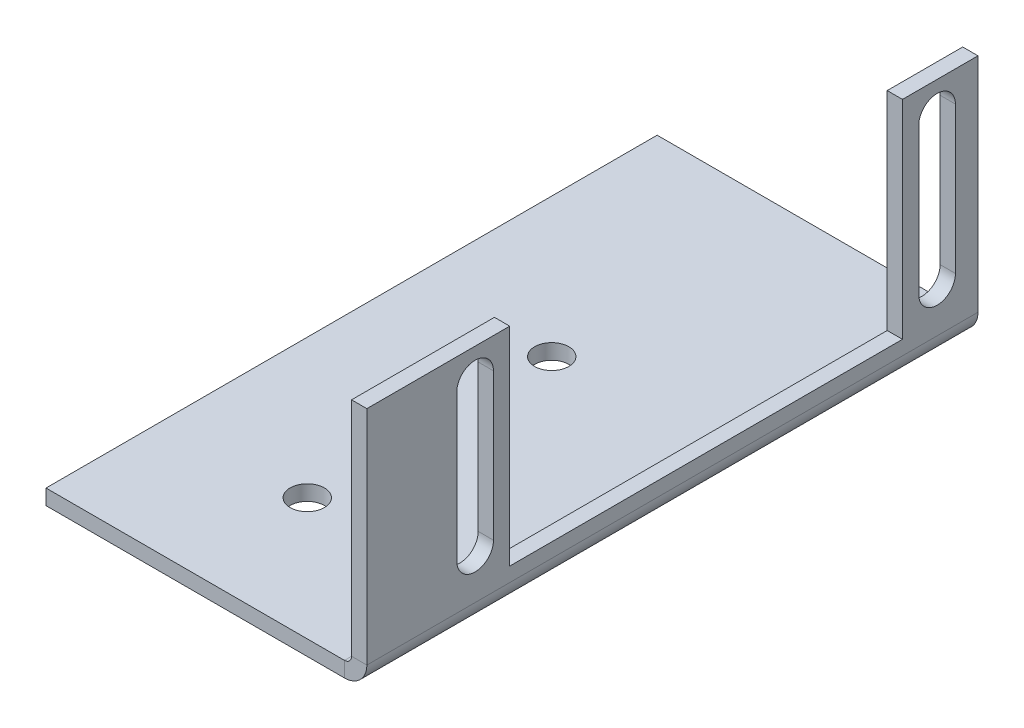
ISO-10303-21;
HEADER;
FILE_DESCRIPTION(('STEP AP214'),'2;1');
FILE_NAME('part.step','',(''),(''),'','','');
FILE_SCHEMA(('AUTOMOTIVE_DESIGN { 1 0 10303 214 1 1 1 1 }'));
ENDSEC;
DATA;
#1=APPLICATION_CONTEXT('core data for automotive mechanical design processes');
#2=APPLICATION_PROTOCOL_DEFINITION('international standard','automotive_design',2000,#1);
#3=PRODUCT_CONTEXT('',#1,'mechanical');
#4=PRODUCT('Part','Part','',(#3));
#5=PRODUCT_RELATED_PRODUCT_CATEGORY('part','',(#4));
#6=PRODUCT_DEFINITION_FORMATION('','',#4);
#7=PRODUCT_DEFINITION_CONTEXT('part definition',#1,'design');
#8=PRODUCT_DEFINITION('design','',#6,#7);
#9=PRODUCT_DEFINITION_SHAPE('','',#8);
#10=(LENGTH_UNIT() NAMED_UNIT(*) SI_UNIT(.MILLI.,.METRE.));
#11=(NAMED_UNIT(*) PLANE_ANGLE_UNIT() SI_UNIT($,.RADIAN.));
#12=(NAMED_UNIT(*) SI_UNIT($,.STERADIAN.) SOLID_ANGLE_UNIT());
#13=UNCERTAINTY_MEASURE_WITH_UNIT(LENGTH_MEASURE(1.E-05),#10,'distance_accuracy_value','');
#14=(GEOMETRIC_REPRESENTATION_CONTEXT(3) GLOBAL_UNCERTAINTY_ASSIGNED_CONTEXT((#13)) GLOBAL_UNIT_ASSIGNED_CONTEXT((#10,
#11,#12)) REPRESENTATION_CONTEXT('',''));
#15=CARTESIAN_POINT('',(0.,0.,0.));
#16=DIRECTION('',(0.,0.,1.));
#17=DIRECTION('',(1.,0.,0.));
#18=AXIS2_PLACEMENT_3D('',#15,#16,#17);
#19=CARTESIAN_POINT('',(33.3375000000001,23.8125,0.));
#20=DIRECTION('',(0.,-1.,0.));
#21=DIRECTION('',(1.,0.,0.));
#22=AXIS2_PLACEMENT_3D('',#19,#20,#21);
#23=PLANE('',#22);
#24=DIRECTION('',(0.,0.,1.));
#25=VECTOR('',#24,1.);
#26=CARTESIAN_POINT('',(33.3375000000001,23.8125,0.));
#27=LINE('',#26,#25);
#28=CARTESIAN_POINT('',(33.3375000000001,23.8125,-14.846));
#29=VERTEX_POINT('',#28);
#30=CARTESIAN_POINT('',(33.3375000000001,23.8125,0.));
#31=VERTEX_POINT('',#30);
#32=EDGE_CURVE('E272',#29,#31,#27,.T.);
#33=ORIENTED_EDGE('',*,*,#32,.F.);
#34=DIRECTION('',(-1.,0.,0.));
#35=VECTOR('',#34,1.);
#36=CARTESIAN_POINT('',(33.3375000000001,23.8125,-14.846));
#37=LINE('',#36,#35);
#38=CARTESIAN_POINT('',(31.7500000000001,23.8125,-14.846));
#39=VERTEX_POINT('',#38);
#40=EDGE_CURVE('E336',#29,#39,#37,.T.);
#41=ORIENTED_EDGE('',*,*,#40,.T.);
#42=DIRECTION('',(0.,0.,1.));
#43=VECTOR('',#42,1.);
#44=CARTESIAN_POINT('',(31.7500000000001,23.8125,0.));
#45=LINE('',#44,#43);
#46=CARTESIAN_POINT('',(31.7500000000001,23.8125,0.));
#47=VERTEX_POINT('',#46);
#48=EDGE_CURVE('E281',#39,#47,#45,.T.);
#49=ORIENTED_EDGE('',*,*,#48,.T.);
#50=DIRECTION('',(-1.,0.,0.));
#51=VECTOR('',#50,1.);
#52=CARTESIAN_POINT('',(33.3375000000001,23.8125,0.));
#53=LINE('',#52,#51);
#54=EDGE_CURVE('E276',#31,#47,#53,.T.);
#55=ORIENTED_EDGE('',*,*,#54,.F.);
#56=EDGE_LOOP('',(#33,#41,#49,#55));
#57=FACE_BOUND('',#56,.T.);
#58=ADVANCED_FACE('F40',(#57),#23,.F.);
#59=CARTESIAN_POINT('',(0.,-1.5875,-63.5));
#60=DIRECTION('',(0.,0.,-1.));
#61=DIRECTION('',(-1.,0.,0.));
#62=AXIS2_PLACEMENT_3D('',#59,#60,#61);
#63=PLANE('',#62);
#64=DIRECTION('',(-1.,0.,0.));
#65=VECTOR('',#64,1.);
#66=CARTESIAN_POINT('',(0.,0.,-63.5));
#67=LINE('',#66,#65);
#68=CARTESIAN_POINT('',(31.0134,0.,-63.5));
#69=VERTEX_POINT('',#68);
#70=CARTESIAN_POINT('',(0.,0.,-63.5));
#71=VERTEX_POINT('',#70);
#72=EDGE_CURVE('E317',#69,#71,#67,.T.);
#73=ORIENTED_EDGE('',*,*,#72,.F.);
#74=DIRECTION('',(0.,-1.,0.));
#75=VECTOR('',#74,1.);
#76=CARTESIAN_POINT('',(31.0134,0.,-63.5));
#77=LINE('',#76,#75);
#78=CARTESIAN_POINT('',(31.0134,-1.5875,-63.5));
#79=VERTEX_POINT('',#78);
#80=EDGE_CURVE('E297',#69,#79,#77,.T.);
#81=ORIENTED_EDGE('',*,*,#80,.T.);
#82=DIRECTION('',(-1.,0.,0.));
#83=VECTOR('',#82,1.);
#84=CARTESIAN_POINT('',(0.,-1.5875,-63.5));
#85=LINE('',#84,#83);
#86=CARTESIAN_POINT('',(0.,-1.5875,-63.5));
#87=VERTEX_POINT('',#86);
#88=EDGE_CURVE('E320',#79,#87,#85,.T.);
#89=ORIENTED_EDGE('',*,*,#88,.T.);
#90=DIRECTION('',(0.,1.,0.));
#91=VECTOR('',#90,1.);
#92=CARTESIAN_POINT('',(0.,-1.5875,-63.5));
#93=LINE('',#92,#91);
#94=EDGE_CURVE('E329',#87,#71,#93,.T.);
#95=ORIENTED_EDGE('',*,*,#94,.T.);
#96=EDGE_LOOP('',(#73,#81,#89,#95));
#97=FACE_BOUND('',#96,.T.);
#98=ADVANCED_FACE('F386',(#97),#63,.T.);
#99=CARTESIAN_POINT('',(0.,-1.5875,0.));
#100=DIRECTION('',(0.,-1.,0.));
#101=DIRECTION('',(0.,0.,-1.));
#102=AXIS2_PLACEMENT_3D('',#99,#100,#101);
#103=PLANE('',#102);
#104=CARTESIAN_POINT('',(14.44625,-1.5875,-38.1));
#105=DIRECTION('',(0.,1.,0.));
#106=DIRECTION('',(0.,0.,1.));
#107=AXIS2_PLACEMENT_3D('',#104,#105,#106);
#108=CIRCLE('',#107,1.778);
#109=CARTESIAN_POINT('',(14.44625,-1.5875,-36.322));
#110=VERTEX_POINT('',#109);
#111=EDGE_CURVE('E244',#110,#110,#108,.T.);
#112=ORIENTED_EDGE('',*,*,#111,.T.);
#113=EDGE_LOOP('',(#112));
#114=FACE_BOUND('',#113,.T.);
#115=CARTESIAN_POINT('',(14.44625,-1.5875,-12.7));
#116=DIRECTION('',(0.,1.,0.));
#117=DIRECTION('',(0.,0.,1.));
#118=AXIS2_PLACEMENT_3D('',#115,#116,#117);
#119=CIRCLE('',#118,1.778);
#120=CARTESIAN_POINT('',(14.44625,-1.5875,-10.922));
#121=VERTEX_POINT('',#120);
#122=EDGE_CURVE('E251',#121,#121,#119,.T.);
#123=ORIENTED_EDGE('',*,*,#122,.T.);
#124=EDGE_LOOP('',(#123));
#125=FACE_BOUND('',#124,.T.);
#126=ORIENTED_EDGE('',*,*,#88,.F.);
#127=DIRECTION('',(0.,0.,-1.));
#128=VECTOR('',#127,1.);
#129=CARTESIAN_POINT('',(31.0134,-1.5875,-63.5));
#130=LINE('',#129,#128);
#131=CARTESIAN_POINT('',(31.0134,-1.5875,0.));
#132=VERTEX_POINT('',#131);
#133=EDGE_CURVE('E290',#79,#132,#130,.F.);
#134=ORIENTED_EDGE('',*,*,#133,.T.);
#135=DIRECTION('',(1.,0.,0.));
#136=VECTOR('',#135,1.);
#137=CARTESIAN_POINT('',(0.,-1.5875,0.));
#138=LINE('',#137,#136);
#139=CARTESIAN_POINT('',(0.,-1.5875,0.));
#140=VERTEX_POINT('',#139);
#141=EDGE_CURVE('E316',#140,#132,#138,.T.);
#142=ORIENTED_EDGE('',*,*,#141,.F.);
#143=DIRECTION('',(0.,0.,1.));
#144=VECTOR('',#143,1.);
#145=CARTESIAN_POINT('',(0.,-1.5875,0.));
#146=LINE('',#145,#144);
#147=EDGE_CURVE('E313',#87,#140,#146,.T.);
#148=ORIENTED_EDGE('',*,*,#147,.F.);
#149=EDGE_LOOP('',(#126,#134,#142,#148));
#150=FACE_BOUND('',#149,.T.);
#151=ADVANCED_FACE('F393',(#114,#125,#150),#103,.T.);
#152=CARTESIAN_POINT('',(0.,0.,0.));
#153=DIRECTION('',(0.,-1.,0.));
#154=DIRECTION('',(0.,0.,-1.));
#155=AXIS2_PLACEMENT_3D('',#152,#153,#154);
#156=PLANE('',#155);
#157=CARTESIAN_POINT('',(14.44625,0.,-38.1));
#158=DIRECTION('',(0.,1.,0.));
#159=DIRECTION('',(0.,0.,1.));
#160=AXIS2_PLACEMENT_3D('',#157,#158,#159);
#161=CIRCLE('',#160,1.778);
#162=CARTESIAN_POINT('',(14.44625,0.,-36.322));
#163=VERTEX_POINT('',#162);
#164=EDGE_CURVE('E248',#163,#163,#161,.T.);
#165=ORIENTED_EDGE('',*,*,#164,.F.);
#166=EDGE_LOOP('',(#165));
#167=FACE_BOUND('',#166,.T.);
#168=CARTESIAN_POINT('',(14.44625,0.,-12.7));
#169=DIRECTION('',(0.,1.,0.));
#170=DIRECTION('',(0.,0.,1.));
#171=AXIS2_PLACEMENT_3D('',#168,#169,#170);
#172=CIRCLE('',#171,1.778);
#173=CARTESIAN_POINT('',(14.44625,0.,-10.922));
#174=VERTEX_POINT('',#173);
#175=EDGE_CURVE('E243',#174,#174,#172,.T.);
#176=ORIENTED_EDGE('',*,*,#175,.F.);
#177=EDGE_LOOP('',(#176));
#178=FACE_BOUND('',#177,.T.);
#179=DIRECTION('',(0.,0.,-1.));
#180=VECTOR('',#179,1.);
#181=CARTESIAN_POINT('',(31.0134,0.,-63.5));
#182=LINE('',#181,#180);
#183=CARTESIAN_POINT('',(31.0134,0.,0.));
#184=VERTEX_POINT('',#183);
#185=EDGE_CURVE('E303',#69,#184,#182,.F.);
#186=ORIENTED_EDGE('',*,*,#185,.F.);
#187=ORIENTED_EDGE('',*,*,#72,.T.);
#188=DIRECTION('',(0.,0.,1.));
#189=VECTOR('',#188,1.);
#190=CARTESIAN_POINT('',(0.,0.,0.));
#191=LINE('',#190,#189);
#192=CARTESIAN_POINT('',(0.,0.,0.));
#193=VERTEX_POINT('',#192);
#194=EDGE_CURVE('E310',#71,#193,#191,.T.);
#195=ORIENTED_EDGE('',*,*,#194,.T.);
#196=DIRECTION('',(1.,0.,0.));
#197=VECTOR('',#196,1.);
#198=CARTESIAN_POINT('',(0.,0.,0.));
#199=LINE('',#198,#197);
#200=EDGE_CURVE('E325',#193,#184,#199,.T.);
#201=ORIENTED_EDGE('',*,*,#200,.T.);
#202=EDGE_LOOP('',(#186,#187,#195,#201));
#203=FACE_BOUND('',#202,.T.);
#204=ADVANCED_FACE('F436',(#167,#178,#203),#156,.F.);
#205=CARTESIAN_POINT('',(0.,-1.5875,0.));
#206=DIRECTION('',(-1.,0.,0.));
#207=DIRECTION('',(0.,0.,1.));
#208=AXIS2_PLACEMENT_3D('',#205,#206,#207);
#209=PLANE('',#208);
#210=ORIENTED_EDGE('',*,*,#194,.F.);
#211=ORIENTED_EDGE('',*,*,#94,.F.);
#212=ORIENTED_EDGE('',*,*,#147,.T.);
#213=DIRECTION('',(0.,1.,0.));
#214=VECTOR('',#213,1.);
#215=CARTESIAN_POINT('',(0.,-1.5875,0.));
#216=LINE('',#215,#214);
#217=EDGE_CURVE('E322',#140,#193,#216,.T.);
#218=ORIENTED_EDGE('',*,*,#217,.T.);
#219=EDGE_LOOP('',(#210,#211,#212,#218));
#220=FACE_BOUND('',#219,.T.);
#221=ADVANCED_FACE('F42',(#220),#209,.T.);
#222=CARTESIAN_POINT('',(0.,-1.5875,0.));
#223=DIRECTION('',(0.,0.,1.));
#224=DIRECTION('',(1.,0.,0.));
#225=AXIS2_PLACEMENT_3D('',#222,#223,#224);
#226=PLANE('',#225);
#227=DIRECTION('',(0.,-1.,0.));
#228=VECTOR('',#227,1.);
#229=CARTESIAN_POINT('',(31.0134,0.,0.));
#230=LINE('',#229,#228);
#231=EDGE_CURVE('E307',#184,#132,#230,.T.);
#232=ORIENTED_EDGE('',*,*,#231,.F.);
#233=ORIENTED_EDGE('',*,*,#200,.F.);
#234=ORIENTED_EDGE('',*,*,#217,.F.);
#235=ORIENTED_EDGE('',*,*,#141,.T.);
#236=EDGE_LOOP('',(#232,#233,#234,#235));
#237=FACE_BOUND('',#236,.T.);
#238=ADVANCED_FACE('F446',(#237),#226,.T.);
#239=CARTESIAN_POINT('',(31.0134,0.7366,0.));
#240=DIRECTION('',(0.,0.,1.));
#241=DIRECTION('',(1.,0.,0.));
#242=AXIS2_PLACEMENT_3D('',#239,#240,#241);
#243=PLANE('',#242);
#244=DIRECTION('',(1.,0.,0.));
#245=VECTOR('',#244,1.);
#246=CARTESIAN_POINT('',(31.75,0.736599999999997,0.));
#247=LINE('',#246,#245);
#248=CARTESIAN_POINT('',(31.75,0.736599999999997,0.));
#249=VERTEX_POINT('',#248);
#250=CARTESIAN_POINT('',(33.3375,0.736599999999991,0.));
#251=VERTEX_POINT('',#250);
#252=EDGE_CURVE('E247',#249,#251,#247,.T.);
#253=ORIENTED_EDGE('',*,*,#252,.F.);
#254=CARTESIAN_POINT('',(31.0134,0.7366,0.));
#255=DIRECTION('',(0.,0.,-1.));
#256=DIRECTION('',(-1.,0.,0.));
#257=AXIS2_PLACEMENT_3D('',#254,#255,#256);
#258=CIRCLE('',#257,0.7366);
#259=EDGE_CURVE('E300',#184,#249,#258,.F.);
#260=ORIENTED_EDGE('',*,*,#259,.F.);
#261=ORIENTED_EDGE('',*,*,#231,.T.);
#262=CARTESIAN_POINT('',(31.0134,0.7366,0.));
#263=DIRECTION('',(0.,0.,-1.));
#264=DIRECTION('',(-1.,0.,0.));
#265=AXIS2_PLACEMENT_3D('',#262,#263,#264);
#266=CIRCLE('',#265,2.3241);
#267=EDGE_CURVE('E293',#132,#251,#266,.F.);
#268=ORIENTED_EDGE('',*,*,#267,.T.);
#269=EDGE_LOOP('',(#253,#260,#261,#268));
#270=FACE_BOUND('',#269,.T.);
#271=ADVANCED_FACE('F448',(#270),#243,.T.);
#272=CARTESIAN_POINT('',(31.0134,0.7366,-63.5));
#273=DIRECTION('',(0.,0.,1.));
#274=DIRECTION('',(1.,0.,0.));
#275=AXIS2_PLACEMENT_3D('',#272,#273,#274);
#276=PLANE('',#275);
#277=CARTESIAN_POINT('',(31.0134,0.7366,-63.5));
#278=DIRECTION('',(0.,0.,-1.));
#279=DIRECTION('',(-1.,0.,0.));
#280=AXIS2_PLACEMENT_3D('',#277,#278,#279);
#281=CIRCLE('',#280,0.7366);
#282=CARTESIAN_POINT('',(31.75,0.736599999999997,-63.5));
#283=VERTEX_POINT('',#282);
#284=EDGE_CURVE('E289',#283,#69,#281,.T.);
#285=ORIENTED_EDGE('',*,*,#284,.F.);
#286=DIRECTION('',(1.,0.,0.));
#287=VECTOR('',#286,1.);
#288=CARTESIAN_POINT('',(31.75,0.736599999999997,-63.5));
#289=LINE('',#288,#287);
#290=CARTESIAN_POINT('',(33.3375,0.736599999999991,-63.5));
#291=VERTEX_POINT('',#290);
#292=EDGE_CURVE('E258',#283,#291,#289,.T.);
#293=ORIENTED_EDGE('',*,*,#292,.T.);
#294=CARTESIAN_POINT('',(31.0134,0.7366,-63.5));
#295=DIRECTION('',(0.,0.,-1.));
#296=DIRECTION('',(-1.,0.,0.));
#297=AXIS2_PLACEMENT_3D('',#294,#295,#296);
#298=CIRCLE('',#297,2.3241);
#299=EDGE_CURVE('E294',#291,#79,#298,.T.);
#300=ORIENTED_EDGE('',*,*,#299,.T.);
#301=ORIENTED_EDGE('',*,*,#80,.F.);
#302=EDGE_LOOP('',(#285,#293,#300,#301));
#303=FACE_BOUND('',#302,.T.);
#304=ADVANCED_FACE('F429',(#303),#276,.F.);
#305=CARTESIAN_POINT('',(31.0134,0.7366,-63.5));
#306=DIRECTION('',(0.,0.,-1.));
#307=DIRECTION('',(1.,0.,0.));
#308=AXIS2_PLACEMENT_3D('',#305,#306,#307);
#309=CYLINDRICAL_SURFACE('',#308,2.3241);
#310=ORIENTED_EDGE('',*,*,#133,.F.);
#311=ORIENTED_EDGE('',*,*,#299,.F.);
#312=DIRECTION('',(0.,0.,1.));
#313=VECTOR('',#312,1.);
#314=CARTESIAN_POINT('',(33.3375,0.736599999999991,0.));
#315=LINE('',#314,#313);
#316=EDGE_CURVE('E261',#291,#251,#315,.T.);
#317=ORIENTED_EDGE('',*,*,#316,.T.);
#318=ORIENTED_EDGE('',*,*,#267,.F.);
#319=EDGE_LOOP('',(#310,#311,#317,#318));
#320=FACE_BOUND('',#319,.T.);
#321=ADVANCED_FACE('F451',(#320),#309,.T.);
#322=CARTESIAN_POINT('',(31.0134,0.7366,-63.5));
#323=DIRECTION('',(0.,0.,-1.));
#324=DIRECTION('',(1.,0.,0.));
#325=AXIS2_PLACEMENT_3D('',#322,#323,#324);
#326=CYLINDRICAL_SURFACE('',#325,0.7366);
#327=ORIENTED_EDGE('',*,*,#185,.T.);
#328=ORIENTED_EDGE('',*,*,#259,.T.);
#329=DIRECTION('',(0.,0.,-1.));
#330=VECTOR('',#329,1.);
#331=CARTESIAN_POINT('',(31.75,0.736599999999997,0.));
#332=LINE('',#331,#330);
#333=EDGE_CURVE('E256',#249,#283,#332,.T.);
#334=ORIENTED_EDGE('',*,*,#333,.T.);
#335=ORIENTED_EDGE('',*,*,#284,.T.);
#336=EDGE_LOOP('',(#327,#328,#334,#335));
#337=FACE_BOUND('',#336,.T.);
#338=ADVANCED_FACE('F432',(#337),#326,.F.);
#339=CARTESIAN_POINT('',(33.3375,0.,0.));
#340=DIRECTION('',(0.,0.,-1.));
#341=DIRECTION('',(-1.,0.,0.));
#342=AXIS2_PLACEMENT_3D('',#339,#340,#341);
#343=PLANE('',#342);
#344=ORIENTED_EDGE('',*,*,#252,.T.);
#345=DIRECTION('',(0.,-1.,0.));
#346=VECTOR('',#345,1.);
#347=CARTESIAN_POINT('',(33.3375,0.,0.));
#348=LINE('',#347,#346);
#349=EDGE_CURVE('E266',#31,#251,#348,.T.);
#350=ORIENTED_EDGE('',*,*,#349,.F.);
#351=ORIENTED_EDGE('',*,*,#54,.T.);
#352=DIRECTION('',(0.,-1.,0.));
#353=VECTOR('',#352,1.);
#354=CARTESIAN_POINT('',(31.75,0.,0.));
#355=LINE('',#354,#353);
#356=EDGE_CURVE('E265',#47,#249,#355,.T.);
#357=ORIENTED_EDGE('',*,*,#356,.T.);
#358=EDGE_LOOP('',(#344,#350,#351,#357));
#359=FACE_BOUND('',#358,.T.);
#360=ADVANCED_FACE('F382',(#359),#343,.F.);
#361=CARTESIAN_POINT('',(33.3375000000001,23.8125,-63.5));
#362=DIRECTION('',(0.,0.,1.));
#363=DIRECTION('',(1.,0.,0.));
#364=AXIS2_PLACEMENT_3D('',#361,#362,#363);
#365=PLANE('',#364);
#366=ORIENTED_EDGE('',*,*,#292,.F.);
#367=DIRECTION('',(0.,1.,0.));
#368=VECTOR('',#367,1.);
#369=CARTESIAN_POINT('',(31.7500000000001,23.8125,-63.5));
#370=LINE('',#369,#368);
#371=CARTESIAN_POINT('',(31.7500000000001,23.8125,-63.5));
#372=VERTEX_POINT('',#371);
#373=EDGE_CURVE('E279',#283,#372,#370,.T.);
#374=ORIENTED_EDGE('',*,*,#373,.T.);
#375=DIRECTION('',(-1.,0.,0.));
#376=VECTOR('',#375,1.);
#377=CARTESIAN_POINT('',(33.3375000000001,23.8125,-63.5));
#378=LINE('',#377,#376);
#379=CARTESIAN_POINT('',(33.3375000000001,23.8125,-63.5));
#380=VERTEX_POINT('',#379);
#381=EDGE_CURVE('E286',#380,#372,#378,.T.);
#382=ORIENTED_EDGE('',*,*,#381,.F.);
#383=DIRECTION('',(0.,1.,0.));
#384=VECTOR('',#383,1.);
#385=CARTESIAN_POINT('',(33.3375000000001,23.8125,-63.5));
#386=LINE('',#385,#384);
#387=EDGE_CURVE('E269',#291,#380,#386,.T.);
#388=ORIENTED_EDGE('',*,*,#387,.F.);
#389=EDGE_LOOP('',(#366,#374,#382,#388));
#390=FACE_BOUND('',#389,.T.);
#391=ADVANCED_FACE('F373',(#390),#365,.F.);
#392=CARTESIAN_POINT('',(33.3375,-1.16565029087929E-13,0.));
#393=DIRECTION('',(-1.,0.,0.));
#394=DIRECTION('',(0.,-1.,0.));
#395=AXIS2_PLACEMENT_3D('',#392,#393,#394);
#396=PLANE('',#395);
#397=DIRECTION('',(0.,-1.,0.));
#398=VECTOR('',#397,1.);
#399=CARTESIAN_POINT('',(33.3375000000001,20.6375,-57.345));
#400=LINE('',#399,#398);
#401=CARTESIAN_POINT('',(33.3375000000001,20.6375000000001,-57.345));
#402=VERTEX_POINT('',#401);
#403=CARTESIAN_POINT('',(33.3375,5.3975,-57.345));
#404=VERTEX_POINT('',#403);
#405=EDGE_CURVE('E211',#402,#404,#400,.T.);
#406=ORIENTED_EDGE('',*,*,#405,.F.);
#407=CARTESIAN_POINT('',(33.3375000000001,20.6375,-59.25));
#408=DIRECTION('',(1.,0.,0.));
#409=DIRECTION('',(0.,-1.,0.));
#410=AXIS2_PLACEMENT_3D('',#407,#408,#409);
#411=CIRCLE('',#410,1.905);
#412=CARTESIAN_POINT('',(33.3375000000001,20.6375,-61.155));
#413=VERTEX_POINT('',#412);
#414=EDGE_CURVE('E55',#413,#402,#411,.T.);
#415=ORIENTED_EDGE('',*,*,#414,.F.);
#416=DIRECTION('',(0.,1.,0.));
#417=VECTOR('',#416,1.);
#418=CARTESIAN_POINT('',(33.3375000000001,20.6375,-61.155));
#419=LINE('',#418,#417);
#420=CARTESIAN_POINT('',(33.3375,5.3975,-61.155));
#421=VERTEX_POINT('',#420);
#422=EDGE_CURVE('E217',#421,#413,#419,.T.);
#423=ORIENTED_EDGE('',*,*,#422,.F.);
#424=CARTESIAN_POINT('',(33.3375,5.3975,-59.25));
#425=DIRECTION('',(1.,0.,0.));
#426=DIRECTION('',(0.,-1.,0.));
#427=AXIS2_PLACEMENT_3D('',#424,#425,#426);
#428=CIRCLE('',#427,1.905);
#429=EDGE_CURVE('E214',#404,#421,#428,.T.);
#430=ORIENTED_EDGE('',*,*,#429,.F.);
#431=EDGE_LOOP('',(#406,#415,#423,#430));
#432=FACE_BOUND('',#431,.T.);
#433=DIRECTION('',(0.,-1.,0.));
#434=VECTOR('',#433,1.);
#435=CARTESIAN_POINT('',(33.3375000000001,20.6375,-9.34500000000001));
#436=LINE('',#435,#434);
#437=CARTESIAN_POINT('',(33.3375000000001,20.6375000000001,-9.34500000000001));
#438=VERTEX_POINT('',#437);
#439=CARTESIAN_POINT('',(33.3375,5.3975,-9.34500000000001));
#440=VERTEX_POINT('',#439);
#441=EDGE_CURVE('E193',#438,#440,#436,.T.);
#442=ORIENTED_EDGE('',*,*,#441,.F.);
#443=CARTESIAN_POINT('',(33.3375000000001,20.6375,-11.25));
#444=DIRECTION('',(1.,0.,0.));
#445=DIRECTION('',(0.,1.,0.));
#446=AXIS2_PLACEMENT_3D('',#443,#444,#445);
#447=CIRCLE('',#446,1.905);
#448=CARTESIAN_POINT('',(33.3375000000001,20.6375,-13.155));
#449=VERTEX_POINT('',#448);
#450=EDGE_CURVE('E63',#449,#438,#447,.T.);
#451=ORIENTED_EDGE('',*,*,#450,.F.);
#452=DIRECTION('',(0.,1.,0.));
#453=VECTOR('',#452,1.);
#454=CARTESIAN_POINT('',(33.3375000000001,20.6375,-13.155));
#455=LINE('',#454,#453);
#456=CARTESIAN_POINT('',(33.3375,5.3975,-13.155));
#457=VERTEX_POINT('',#456);
#458=EDGE_CURVE('E200',#457,#449,#455,.T.);
#459=ORIENTED_EDGE('',*,*,#458,.F.);
#460=CARTESIAN_POINT('',(33.3375,5.3975,-11.25));
#461=DIRECTION('',(1.,0.,0.));
#462=DIRECTION('',(0.,1.,0.));
#463=AXIS2_PLACEMENT_3D('',#460,#461,#462);
#464=CIRCLE('',#463,1.905);
#465=EDGE_CURVE('E183',#440,#457,#464,.T.);
#466=ORIENTED_EDGE('',*,*,#465,.F.);
#467=EDGE_LOOP('',(#442,#451,#459,#466));
#468=FACE_BOUND('',#467,.T.);
#469=DIRECTION('',(0.,0.,-1.));
#470=VECTOR('',#469,1.);
#471=CARTESIAN_POINT('',(33.3375,2.2225,-14.846));
#472=LINE('',#471,#470);
#473=CARTESIAN_POINT('',(33.3375,2.2225,-14.846));
#474=VERTEX_POINT('',#473);
#475=CARTESIAN_POINT('',(33.3375,2.2225,-55.654));
#476=VERTEX_POINT('',#475);
#477=EDGE_CURVE('E230',#474,#476,#472,.T.);
#478=ORIENTED_EDGE('',*,*,#477,.F.);
#479=DIRECTION('',(0.,-1.,0.));
#480=VECTOR('',#479,1.);
#481=CARTESIAN_POINT('',(33.3375000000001,23.8125,-14.846));
#482=LINE('',#481,#480);
#483=EDGE_CURVE('E207',#29,#474,#482,.T.);
#484=ORIENTED_EDGE('',*,*,#483,.F.);
#485=ORIENTED_EDGE('',*,*,#32,.T.);
#486=ORIENTED_EDGE('',*,*,#349,.T.);
#487=ORIENTED_EDGE('',*,*,#316,.F.);
#488=ORIENTED_EDGE('',*,*,#387,.T.);
#489=CARTESIAN_POINT('',(33.3375000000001,23.8125,-55.654));
#490=VERTEX_POINT('',#489);
#491=EDGE_CURVE('E273',#380,#490,#27,.T.);
#492=ORIENTED_EDGE('',*,*,#491,.T.);
#493=DIRECTION('',(0.,1.,0.));
#494=VECTOR('',#493,1.);
#495=CARTESIAN_POINT('',(33.3375000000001,23.8125,-55.654));
#496=LINE('',#495,#494);
#497=EDGE_CURVE('E233',#476,#490,#496,.T.);
#498=ORIENTED_EDGE('',*,*,#497,.F.);
#499=EDGE_LOOP('',(#478,#484,#485,#486,#487,#488,#492,#498));
#500=FACE_BOUND('',#499,.T.);
#501=ADVANCED_FACE('F197',(#432,#468,#500),#396,.F.);
#502=CARTESIAN_POINT('',(31.75,-1.11022302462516E-13,0.));
#503=DIRECTION('',(-1.,0.,0.));
#504=DIRECTION('',(0.,-1.,0.));
#505=AXIS2_PLACEMENT_3D('',#502,#503,#504);
#506=PLANE('',#505);
#507=CARTESIAN_POINT('',(31.7500000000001,20.6375,-59.25));
#508=DIRECTION('',(-1.,0.,0.));
#509=DIRECTION('',(0.,-1.,0.));
#510=AXIS2_PLACEMENT_3D('',#507,#508,#509);
#511=CIRCLE('',#510,1.905);
#512=CARTESIAN_POINT('',(31.75,20.6375,-57.345));
#513=VERTEX_POINT('',#512);
#514=CARTESIAN_POINT('',(31.75,20.6375,-61.155));
#515=VERTEX_POINT('',#514);
#516=EDGE_CURVE('E11',#513,#515,#511,.T.);
#517=ORIENTED_EDGE('',*,*,#516,.F.);
#518=DIRECTION('',(0.,1.,0.));
#519=VECTOR('',#518,1.);
#520=CARTESIAN_POINT('',(31.75,-1.11022302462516E-13,-57.345));
#521=LINE('',#520,#519);
#522=CARTESIAN_POINT('',(31.75,5.3975,-57.345));
#523=VERTEX_POINT('',#522);
#524=EDGE_CURVE('E348',#523,#513,#521,.T.);
#525=ORIENTED_EDGE('',*,*,#524,.F.);
#526=CARTESIAN_POINT('',(31.75,5.39750000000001,-59.25));
#527=DIRECTION('',(-1.,0.,0.));
#528=DIRECTION('',(0.,-1.,0.));
#529=AXIS2_PLACEMENT_3D('',#526,#527,#528);
#530=CIRCLE('',#529,1.905);
#531=CARTESIAN_POINT('',(31.75,5.39750000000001,-61.155));
#532=VERTEX_POINT('',#531);
#533=EDGE_CURVE('E350',#532,#523,#530,.T.);
#534=ORIENTED_EDGE('',*,*,#533,.F.);
#535=DIRECTION('',(0.,-1.,0.));
#536=VECTOR('',#535,1.);
#537=CARTESIAN_POINT('',(31.75,-1.11022302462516E-13,-61.155));
#538=LINE('',#537,#536);
#539=EDGE_CURVE('E48',#515,#532,#538,.T.);
#540=ORIENTED_EDGE('',*,*,#539,.F.);
#541=EDGE_LOOP('',(#517,#525,#534,#540));
#542=FACE_BOUND('',#541,.T.);
#543=CARTESIAN_POINT('',(31.7500000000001,20.6375,-11.25));
#544=DIRECTION('',(-1.,0.,0.));
#545=DIRECTION('',(0.,-1.,0.));
#546=AXIS2_PLACEMENT_3D('',#543,#544,#545);
#547=CIRCLE('',#546,1.905);
#548=CARTESIAN_POINT('',(31.75,20.6375,-9.34500000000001));
#549=VERTEX_POINT('',#548);
#550=CARTESIAN_POINT('',(31.75,20.6375,-13.155));
#551=VERTEX_POINT('',#550);
#552=EDGE_CURVE('E346',#549,#551,#547,.T.);
#553=ORIENTED_EDGE('',*,*,#552,.F.);
#554=DIRECTION('',(0.,1.,0.));
#555=VECTOR('',#554,1.);
#556=CARTESIAN_POINT('',(31.75,-1.11022302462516E-13,-9.34500000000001));
#557=LINE('',#556,#555);
#558=CARTESIAN_POINT('',(31.75,5.3975,-9.34500000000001));
#559=VERTEX_POINT('',#558);
#560=EDGE_CURVE('E341',#559,#549,#557,.T.);
#561=ORIENTED_EDGE('',*,*,#560,.F.);
#562=CARTESIAN_POINT('',(31.75,5.39750000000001,-11.25));
#563=DIRECTION('',(-1.,0.,0.));
#564=DIRECTION('',(0.,-1.,0.));
#565=AXIS2_PLACEMENT_3D('',#562,#563,#564);
#566=CIRCLE('',#565,1.905);
#567=CARTESIAN_POINT('',(31.75,5.39750000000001,-13.155));
#568=VERTEX_POINT('',#567);
#569=EDGE_CURVE('E186',#568,#559,#566,.T.);
#570=ORIENTED_EDGE('',*,*,#569,.F.);
#571=DIRECTION('',(0.,-1.,0.));
#572=VECTOR('',#571,1.);
#573=CARTESIAN_POINT('',(31.75,-1.11022302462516E-13,-13.155));
#574=LINE('',#573,#572);
#575=EDGE_CURVE('E344',#551,#568,#574,.T.);
#576=ORIENTED_EDGE('',*,*,#575,.F.);
#577=EDGE_LOOP('',(#553,#561,#570,#576));
#578=FACE_BOUND('',#577,.T.);
#579=DIRECTION('',(0.,1.,0.));
#580=VECTOR('',#579,1.);
#581=CARTESIAN_POINT('',(31.75,-1.07443742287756E-13,-14.846));
#582=LINE('',#581,#580);
#583=CARTESIAN_POINT('',(31.75,2.22250000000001,-14.846));
#584=VERTEX_POINT('',#583);
#585=EDGE_CURVE('E241',#584,#39,#582,.T.);
#586=ORIENTED_EDGE('',*,*,#585,.F.);
#587=DIRECTION('',(0.,0.,1.));
#588=VECTOR('',#587,1.);
#589=CARTESIAN_POINT('',(31.75,2.22250000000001,0.));
#590=LINE('',#589,#588);
#591=CARTESIAN_POINT('',(31.75,2.22250000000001,-55.654));
#592=VERTEX_POINT('',#591);
#593=EDGE_CURVE('E339',#592,#584,#590,.T.);
#594=ORIENTED_EDGE('',*,*,#593,.F.);
#595=DIRECTION('',(0.,-1.,0.));
#596=VECTOR('',#595,1.);
#597=CARTESIAN_POINT('',(31.75,-1.28909157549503E-13,-55.654));
#598=LINE('',#597,#596);
#599=CARTESIAN_POINT('',(31.7500000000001,23.8125,-55.654));
#600=VERTEX_POINT('',#599);
#601=EDGE_CURVE('E238',#600,#592,#598,.T.);
#602=ORIENTED_EDGE('',*,*,#601,.F.);
#603=EDGE_CURVE('E270',#372,#600,#45,.T.);
#604=ORIENTED_EDGE('',*,*,#603,.F.);
#605=ORIENTED_EDGE('',*,*,#373,.F.);
#606=ORIENTED_EDGE('',*,*,#333,.F.);
#607=ORIENTED_EDGE('',*,*,#356,.F.);
#608=ORIENTED_EDGE('',*,*,#48,.F.);
#609=EDGE_LOOP('',(#586,#594,#602,#604,#605,#606,#607,#608));
#610=FACE_BOUND('',#609,.T.);
#611=ADVANCED_FACE('F365',(#542,#578,#610),#506,.T.);
#612=ORIENTED_EDGE('',*,*,#603,.T.);
#613=DIRECTION('',(1.,0.,0.));
#614=VECTOR('',#613,1.);
#615=CARTESIAN_POINT('',(33.3375000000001,23.8125,-55.654));
#616=LINE('',#615,#614);
#617=EDGE_CURVE('E332',#600,#490,#616,.T.);
#618=ORIENTED_EDGE('',*,*,#617,.T.);
#619=ORIENTED_EDGE('',*,*,#491,.F.);
#620=ORIENTED_EDGE('',*,*,#381,.T.);
#621=EDGE_LOOP('',(#612,#618,#619,#620));
#622=FACE_BOUND('',#621,.T.);
#623=ADVANCED_FACE('F379',(#622),#23,.F.);
#624=CARTESIAN_POINT('',(14.44625,-1.5875,-12.7));
#625=DIRECTION('',(0.,1.,0.));
#626=DIRECTION('',(0.,0.,1.));
#627=AXIS2_PLACEMENT_3D('',#624,#625,#626);
#628=CYLINDRICAL_SURFACE('',#627,1.778);
#629=ORIENTED_EDGE('',*,*,#122,.F.);
#630=EDGE_LOOP('',(#629));
#631=FACE_BOUND('',#630,.T.);
#632=ORIENTED_EDGE('',*,*,#175,.T.);
#633=EDGE_LOOP('',(#632));
#634=FACE_BOUND('',#633,.T.);
#635=ADVANCED_FACE('F398',(#631,#634),#628,.F.);
#636=CARTESIAN_POINT('',(14.44625,-1.5875,-38.1));
#637=DIRECTION('',(0.,1.,0.));
#638=DIRECTION('',(0.,0.,1.));
#639=AXIS2_PLACEMENT_3D('',#636,#637,#638);
#640=CYLINDRICAL_SURFACE('',#639,1.778);
#641=ORIENTED_EDGE('',*,*,#111,.F.);
#642=EDGE_LOOP('',(#641));
#643=FACE_BOUND('',#642,.T.);
#644=ORIENTED_EDGE('',*,*,#164,.T.);
#645=EDGE_LOOP('',(#644));
#646=FACE_BOUND('',#645,.T.);
#647=ADVANCED_FACE('F404',(#643,#646),#640,.F.);
#648=CARTESIAN_POINT('',(0.,23.8125000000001,-14.846));
#649=DIRECTION('',(0.,0.,1.));
#650=DIRECTION('',(0.,-1.,0.));
#651=AXIS2_PLACEMENT_3D('',#648,#649,#650);
#652=PLANE('',#651);
#653=ORIENTED_EDGE('',*,*,#585,.T.);
#654=ORIENTED_EDGE('',*,*,#40,.F.);
#655=ORIENTED_EDGE('',*,*,#483,.T.);
#656=DIRECTION('',(1.,0.,0.));
#657=VECTOR('',#656,1.);
#658=CARTESIAN_POINT('',(0.,2.22250000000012,-14.846));
#659=LINE('',#658,#657);
#660=EDGE_CURVE('E235',#584,#474,#659,.T.);
#661=ORIENTED_EDGE('',*,*,#660,.F.);
#662=EDGE_LOOP('',(#653,#654,#655,#661));
#663=FACE_BOUND('',#662,.T.);
#664=ADVANCED_FACE('F563',(#663),#652,.F.);
#665=CARTESIAN_POINT('',(0.,23.8125000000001,-55.654));
#666=DIRECTION('',(0.,0.,-1.));
#667=DIRECTION('',(0.,1.,0.));
#668=AXIS2_PLACEMENT_3D('',#665,#666,#667);
#669=PLANE('',#668);
#670=ORIENTED_EDGE('',*,*,#601,.T.);
#671=DIRECTION('',(1.,0.,0.));
#672=VECTOR('',#671,1.);
#673=CARTESIAN_POINT('',(0.,2.22250000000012,-55.654));
#674=LINE('',#673,#672);
#675=EDGE_CURVE('E236',#592,#476,#674,.T.);
#676=ORIENTED_EDGE('',*,*,#675,.T.);
#677=ORIENTED_EDGE('',*,*,#497,.T.);
#678=ORIENTED_EDGE('',*,*,#617,.F.);
#679=EDGE_LOOP('',(#670,#676,#677,#678));
#680=FACE_BOUND('',#679,.T.);
#681=ADVANCED_FACE('F417',(#680),#669,.F.);
#682=CARTESIAN_POINT('',(0.,2.22250000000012,-14.846));
#683=DIRECTION('',(0.,-1.,0.));
#684=DIRECTION('',(1.,0.,0.));
#685=AXIS2_PLACEMENT_3D('',#682,#683,#684);
#686=PLANE('',#685);
#687=ORIENTED_EDGE('',*,*,#593,.T.);
#688=ORIENTED_EDGE('',*,*,#660,.T.);
#689=ORIENTED_EDGE('',*,*,#477,.T.);
#690=ORIENTED_EDGE('',*,*,#675,.F.);
#691=EDGE_LOOP('',(#687,#688,#689,#690));
#692=FACE_BOUND('',#691,.T.);
#693=ADVANCED_FACE('F419',(#692),#686,.F.);
#694=CARTESIAN_POINT('',(0.,20.6375000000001,-11.25));
#695=DIRECTION('',(1.,0.,0.));
#696=DIRECTION('',(0.,1.,0.));
#697=AXIS2_PLACEMENT_3D('',#694,#695,#696);
#698=CYLINDRICAL_SURFACE('',#697,1.905);
#699=ORIENTED_EDGE('',*,*,#552,.T.);
#700=DIRECTION('',(1.,0.,0.));
#701=VECTOR('',#700,1.);
#702=CARTESIAN_POINT('',(0.,20.6375000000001,-13.155));
#703=LINE('',#702,#701);
#704=EDGE_CURVE('E205',#551,#449,#703,.T.);
#705=ORIENTED_EDGE('',*,*,#704,.T.);
#706=ORIENTED_EDGE('',*,*,#450,.T.);
#707=DIRECTION('',(1.,0.,0.));
#708=VECTOR('',#707,1.);
#709=CARTESIAN_POINT('',(0.,20.6375000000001,-9.34500000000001));
#710=LINE('',#709,#708);
#711=EDGE_CURVE('E190',#549,#438,#710,.T.);
#712=ORIENTED_EDGE('',*,*,#711,.F.);
#713=EDGE_LOOP('',(#699,#705,#706,#712));
#714=FACE_BOUND('',#713,.T.);
#715=ADVANCED_FACE('F588',(#714),#698,.F.);
#716=CARTESIAN_POINT('',(0.,20.6375000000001,-13.155));
#717=DIRECTION('',(0.,0.,-1.));
#718=DIRECTION('',(-1.,0.,0.));
#719=AXIS2_PLACEMENT_3D('',#716,#717,#718);
#720=PLANE('',#719);
#721=ORIENTED_EDGE('',*,*,#575,.T.);
#722=DIRECTION('',(1.,0.,0.));
#723=VECTOR('',#722,1.);
#724=CARTESIAN_POINT('',(0.,5.39750000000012,-13.155));
#725=LINE('',#724,#723);
#726=EDGE_CURVE('E189',#568,#457,#725,.T.);
#727=ORIENTED_EDGE('',*,*,#726,.T.);
#728=ORIENTED_EDGE('',*,*,#458,.T.);
#729=ORIENTED_EDGE('',*,*,#704,.F.);
#730=EDGE_LOOP('',(#721,#727,#728,#729));
#731=FACE_BOUND('',#730,.T.);
#732=ADVANCED_FACE('F595',(#731),#720,.F.);
#733=CARTESIAN_POINT('',(0.,5.39750000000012,-11.25));
#734=DIRECTION('',(1.,0.,0.));
#735=DIRECTION('',(0.,1.,0.));
#736=AXIS2_PLACEMENT_3D('',#733,#734,#735);
#737=CYLINDRICAL_SURFACE('',#736,1.905);
#738=ORIENTED_EDGE('',*,*,#569,.T.);
#739=DIRECTION('',(1.,0.,0.));
#740=VECTOR('',#739,1.);
#741=CARTESIAN_POINT('',(0.,5.39750000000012,-9.34500000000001));
#742=LINE('',#741,#740);
#743=EDGE_CURVE('E178',#559,#440,#742,.T.);
#744=ORIENTED_EDGE('',*,*,#743,.T.);
#745=ORIENTED_EDGE('',*,*,#465,.T.);
#746=ORIENTED_EDGE('',*,*,#726,.F.);
#747=EDGE_LOOP('',(#738,#744,#745,#746));
#748=FACE_BOUND('',#747,.T.);
#749=ADVANCED_FACE('F180',(#748),#737,.F.);
#750=CARTESIAN_POINT('',(0.,20.6375000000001,-9.34500000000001));
#751=DIRECTION('',(0.,0.,1.));
#752=DIRECTION('',(1.,0.,0.));
#753=AXIS2_PLACEMENT_3D('',#750,#751,#752);
#754=PLANE('',#753);
#755=ORIENTED_EDGE('',*,*,#560,.T.);
#756=ORIENTED_EDGE('',*,*,#711,.T.);
#757=ORIENTED_EDGE('',*,*,#441,.T.);
#758=ORIENTED_EDGE('',*,*,#743,.F.);
#759=EDGE_LOOP('',(#755,#756,#757,#758));
#760=FACE_BOUND('',#759,.T.);
#761=ADVANCED_FACE('F194',(#760),#754,.F.);
#762=CARTESIAN_POINT('',(0.,20.6375000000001,-59.25));
#763=DIRECTION('',(1.,0.,0.));
#764=DIRECTION('',(0.,1.,0.));
#765=AXIS2_PLACEMENT_3D('',#762,#763,#764);
#766=CYLINDRICAL_SURFACE('',#765,1.905);
#767=ORIENTED_EDGE('',*,*,#516,.T.);
#768=DIRECTION('',(1.,0.,0.));
#769=VECTOR('',#768,1.);
#770=CARTESIAN_POINT('',(0.,20.6375000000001,-61.155));
#771=LINE('',#770,#769);
#772=EDGE_CURVE('E221',#515,#413,#771,.T.);
#773=ORIENTED_EDGE('',*,*,#772,.T.);
#774=ORIENTED_EDGE('',*,*,#414,.T.);
#775=DIRECTION('',(1.,0.,0.));
#776=VECTOR('',#775,1.);
#777=CARTESIAN_POINT('',(0.,20.6375000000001,-57.345));
#778=LINE('',#777,#776);
#779=EDGE_CURVE('E220',#513,#402,#778,.T.);
#780=ORIENTED_EDGE('',*,*,#779,.F.);
#781=EDGE_LOOP('',(#767,#773,#774,#780));
#782=FACE_BOUND('',#781,.T.);
#783=ADVANCED_FACE('F370',(#782),#766,.F.);
#784=CARTESIAN_POINT('',(0.,20.6375000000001,-61.155));
#785=DIRECTION('',(0.,0.,-1.));
#786=DIRECTION('',(-1.,0.,0.));
#787=AXIS2_PLACEMENT_3D('',#784,#785,#786);
#788=PLANE('',#787);
#789=ORIENTED_EDGE('',*,*,#539,.T.);
#790=DIRECTION('',(1.,0.,0.));
#791=VECTOR('',#790,1.);
#792=CARTESIAN_POINT('',(0.,5.39750000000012,-61.155));
#793=LINE('',#792,#791);
#794=EDGE_CURVE('E223',#532,#421,#793,.T.);
#795=ORIENTED_EDGE('',*,*,#794,.T.);
#796=ORIENTED_EDGE('',*,*,#422,.T.);
#797=ORIENTED_EDGE('',*,*,#772,.F.);
#798=EDGE_LOOP('',(#789,#795,#796,#797));
#799=FACE_BOUND('',#798,.T.);
#800=ADVANCED_FACE('F356',(#799),#788,.F.);
#801=CARTESIAN_POINT('',(0.,5.39750000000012,-59.25));
#802=DIRECTION('',(1.,0.,0.));
#803=DIRECTION('',(0.,1.,0.));
#804=AXIS2_PLACEMENT_3D('',#801,#802,#803);
#805=CYLINDRICAL_SURFACE('',#804,1.905);
#806=ORIENTED_EDGE('',*,*,#533,.T.);
#807=DIRECTION('',(1.,0.,0.));
#808=VECTOR('',#807,1.);
#809=CARTESIAN_POINT('',(0.,5.39750000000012,-57.345));
#810=LINE('',#809,#808);
#811=EDGE_CURVE('E225',#523,#404,#810,.T.);
#812=ORIENTED_EDGE('',*,*,#811,.T.);
#813=ORIENTED_EDGE('',*,*,#429,.T.);
#814=ORIENTED_EDGE('',*,*,#794,.F.);
#815=EDGE_LOOP('',(#806,#812,#813,#814));
#816=FACE_BOUND('',#815,.T.);
#817=ADVANCED_FACE('F361',(#816),#805,.F.);
#818=CARTESIAN_POINT('',(0.,20.6375000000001,-57.345));
#819=DIRECTION('',(0.,0.,1.));
#820=DIRECTION('',(1.,0.,0.));
#821=AXIS2_PLACEMENT_3D('',#818,#819,#820);
#822=PLANE('',#821);
#823=ORIENTED_EDGE('',*,*,#524,.T.);
#824=ORIENTED_EDGE('',*,*,#779,.T.);
#825=ORIENTED_EDGE('',*,*,#405,.T.);
#826=ORIENTED_EDGE('',*,*,#811,.F.);
#827=EDGE_LOOP('',(#823,#824,#825,#826));
#828=FACE_BOUND('',#827,.T.);
#829=ADVANCED_FACE('F368',(#828),#822,.F.);
#830=CLOSED_SHELL('',(#58,#98,#151,#204,#221,#238,#271,#304,#321,#338,#360,#391,#501,#611,#623,
#635,#647,#664,#681,#693,#715,#732,#749,#761,#783,#800,#817,#829));
#831=MANIFOLD_SOLID_BREP('B2',#830);
#832=ADVANCED_BREP_SHAPE_REPRESENTATION('',(#18,#831),#14);
#833=SHAPE_DEFINITION_REPRESENTATION(#9,#832);
ENDSEC;
END-ISO-10303-21;
